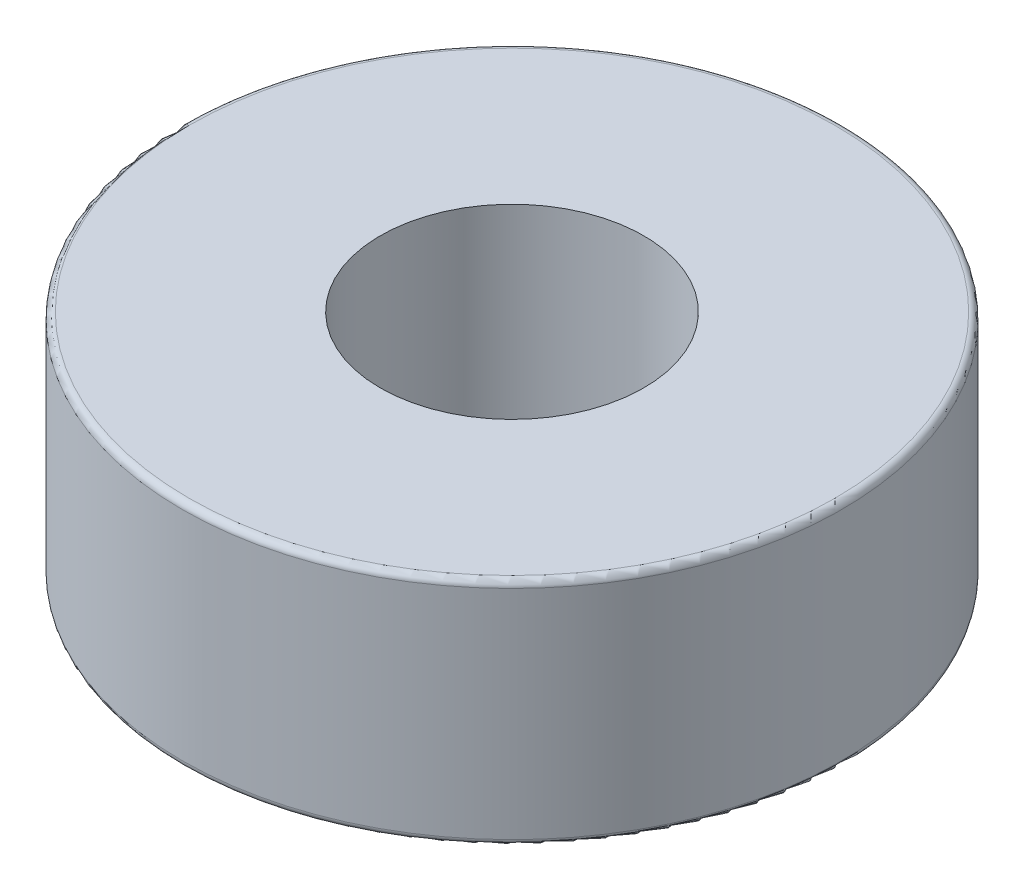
from build123d import *

# Parameters (mm, degrees)
SKETCH1_R           = 10
SKETCH1_R_2         = 4
BOSS_EXTRUDE1_DEPTH = 7
FILLET1_R           = 0.2


with BuildPart() as part:
    # Sketch1 → Boss-Extrude1 (new body)
    with BuildSketch(Plane(origin=(0, 0, 0), x_dir=(1, 0, 0), z_dir=(0, 1, 0))):
        with Locations(Location((0, 0, 0), (0, 0, 270))):
            Circle(SKETCH1_R)
        with Locations(Location((0, 0, 0), (0, 0, 270))):
            Circle(SKETCH1_R_2, mode=Mode.SUBTRACT)
    extrude(amount=BOSS_EXTRUDE1_DEPTH)

    # Fillet1
    fillet1_edges = [part.edges().sort_by_distance(p)[0] for p in [
        (0, 0, -10),
        (0, 7, -10),
    ]]
    fillet(fillet1_edges, radius=FILLET1_R)


solid = part.part
